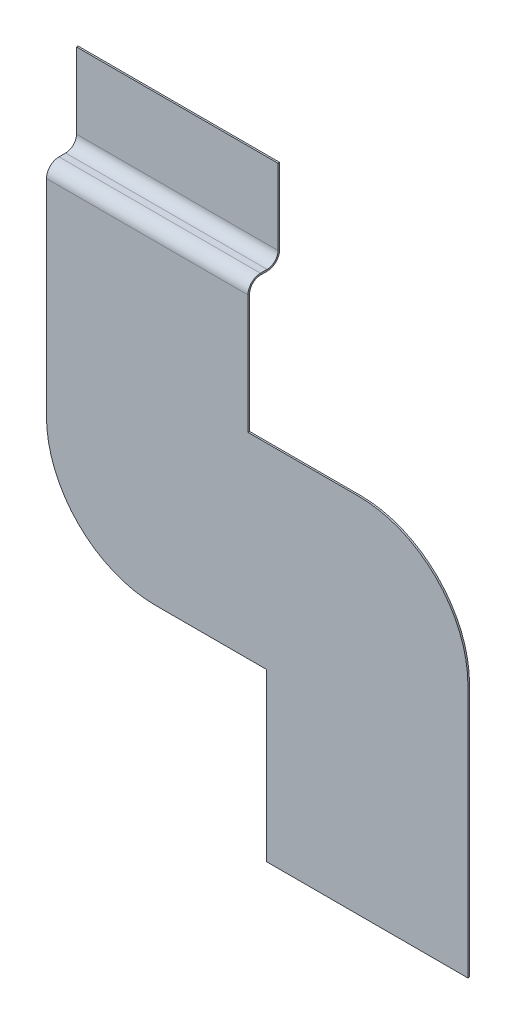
ISO-10303-21;
HEADER;
FILE_DESCRIPTION(('STEP AP214'),'2;1');
FILE_NAME('part.step','',(''),(''),'','','');
FILE_SCHEMA(('AUTOMOTIVE_DESIGN { 1 0 10303 214 1 1 1 1 }'));
ENDSEC;
DATA;
#1=APPLICATION_CONTEXT('core data for automotive mechanical design processes');
#2=APPLICATION_PROTOCOL_DEFINITION('international standard','automotive_design',2000,#1);
#3=PRODUCT_CONTEXT('',#1,'mechanical');
#4=PRODUCT('Part','Part','',(#3));
#5=PRODUCT_RELATED_PRODUCT_CATEGORY('part','',(#4));
#6=PRODUCT_DEFINITION_FORMATION('','',#4);
#7=PRODUCT_DEFINITION_CONTEXT('part definition',#1,'design');
#8=PRODUCT_DEFINITION('design','',#6,#7);
#9=PRODUCT_DEFINITION_SHAPE('','',#8);
#10=(LENGTH_UNIT() NAMED_UNIT(*) SI_UNIT(.MILLI.,.METRE.));
#11=(NAMED_UNIT(*) PLANE_ANGLE_UNIT() SI_UNIT($,.RADIAN.));
#12=(NAMED_UNIT(*) SI_UNIT($,.STERADIAN.) SOLID_ANGLE_UNIT());
#13=UNCERTAINTY_MEASURE_WITH_UNIT(LENGTH_MEASURE(1.E-05),#10,'distance_accuracy_value','');
#14=(GEOMETRIC_REPRESENTATION_CONTEXT(3) GLOBAL_UNCERTAINTY_ASSIGNED_CONTEXT((#13)) GLOBAL_UNIT_ASSIGNED_CONTEXT((#10,
#11,#12)) REPRESENTATION_CONTEXT('',''));
#15=CARTESIAN_POINT('',(0.,0.,0.));
#16=DIRECTION('',(0.,0.,1.));
#17=DIRECTION('',(1.,0.,0.));
#18=AXIS2_PLACEMENT_3D('',#15,#16,#17);
#19=CARTESIAN_POINT('',(82.83487754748,-57.35458374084,-2.399952));
#20=DIRECTION('',(-1.,0.,0.));
#21=DIRECTION('',(0.,0.,-1.));
#22=AXIS2_PLACEMENT_3D('',#19,#20,#21);
#23=CYLINDRICAL_SURFACE('',#22,1.15);
#24=DIRECTION('',(-1.,0.,0.));
#25=VECTOR('',#24,1.);
#26=CARTESIAN_POINT('',(12.19999999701,-57.35458374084,-3.549952));
#27=LINE('',#26,#25);
#28=CARTESIAN_POINT('',(12.19999999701,-57.35458374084,-3.549952));
#29=VERTEX_POINT('',#28);
#30=CARTESIAN_POINT('',(-6.300000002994,-57.35458374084,-3.549952));
#31=VERTEX_POINT('',#30);
#32=EDGE_CURVE('E313',#29,#31,#27,.T.);
#33=ORIENTED_EDGE('',*,*,#32,.F.);
#34=CARTESIAN_POINT('',(12.19999999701,-57.35458374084,-2.399952));
#35=DIRECTION('',(1.,0.,0.));
#36=DIRECTION('',(0.,-1.,0.));
#37=AXIS2_PLACEMENT_3D('',#34,#35,#36);
#38=CIRCLE('',#37,1.15);
#39=CARTESIAN_POINT('',(12.19999999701,-58.50458374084,-2.399952));
#40=VERTEX_POINT('',#39);
#41=EDGE_CURVE('E198',#40,#29,#38,.T.);
#42=ORIENTED_EDGE('',*,*,#41,.F.);
#43=DIRECTION('',(-1.,0.,0.));
#44=VECTOR('',#43,1.);
#45=CARTESIAN_POINT('',(12.19999999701,-58.50458374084,-2.399952));
#46=LINE('',#45,#44);
#47=CARTESIAN_POINT('',(-6.300000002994,-58.50458374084,-2.399952));
#48=VERTEX_POINT('',#47);
#49=EDGE_CURVE('E246',#40,#48,#46,.T.);
#50=ORIENTED_EDGE('',*,*,#49,.T.);
#51=CARTESIAN_POINT('',(-6.300000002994,-57.35458374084,-2.399952));
#52=DIRECTION('',(-1.,0.,0.));
#53=DIRECTION('',(0.,0.,-1.));
#54=AXIS2_PLACEMENT_3D('',#51,#52,#53);
#55=CIRCLE('',#54,1.15);
#56=EDGE_CURVE('E328',#31,#48,#55,.T.);
#57=ORIENTED_EDGE('',*,*,#56,.F.);
#58=EDGE_LOOP('',(#33,#42,#50,#57));
#59=FACE_BOUND('',#58,.T.);
#60=ADVANCED_FACE('F17',(#59),#23,.T.);
#61=CARTESIAN_POINT('',(3.699999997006,-78.43387219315,-1.79));
#62=DIRECTION('',(0.,0.,-1.));
#63=DIRECTION('',(0.,-1.,0.));
#64=AXIS2_PLACEMENT_3D('',#61,#62,#63);
#65=CYLINDRICAL_SURFACE('',#64,10.);
#66=DIRECTION('',(0.,0.,1.));
#67=VECTOR('',#66,1.);
#68=CARTESIAN_POINT('',(3.699999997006,-88.43387219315,-0.79));
#69=LINE('',#68,#67);
#70=CARTESIAN_POINT('',(3.699999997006,-88.43387219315,-0.79));
#71=VERTEX_POINT('',#70);
#72=CARTESIAN_POINT('',(3.699999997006,-88.43387219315,-0.64));
#73=VERTEX_POINT('',#72);
#74=EDGE_CURVE('E11',#71,#73,#69,.T.);
#75=ORIENTED_EDGE('',*,*,#74,.T.);
#76=CARTESIAN_POINT('',(3.699999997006,-78.43387219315,-0.64));
#77=DIRECTION('',(0.,0.,-1.));
#78=DIRECTION('',(0.,-1.,0.));
#79=AXIS2_PLACEMENT_3D('',#76,#77,#78);
#80=CIRCLE('',#79,10.);
#81=CARTESIAN_POINT('',(-6.300000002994,-78.43387219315,-0.64));
#82=VERTEX_POINT('',#81);
#83=EDGE_CURVE('E355',#73,#82,#80,.T.);
#84=ORIENTED_EDGE('',*,*,#83,.T.);
#85=DIRECTION('',(0.,0.,1.));
#86=VECTOR('',#85,1.);
#87=CARTESIAN_POINT('',(-6.300000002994,-78.43387219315,-0.79));
#88=LINE('',#87,#86);
#89=CARTESIAN_POINT('',(-6.300000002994,-78.43387219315,-0.79));
#90=VERTEX_POINT('',#89);
#91=EDGE_CURVE('E323',#90,#82,#88,.T.);
#92=ORIENTED_EDGE('',*,*,#91,.F.);
#93=CARTESIAN_POINT('',(3.699999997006,-78.43387219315,-0.79));
#94=DIRECTION('',(0.,0.,-1.));
#95=DIRECTION('',(0.,-1.,0.));
#96=AXIS2_PLACEMENT_3D('',#93,#94,#95);
#97=CIRCLE('',#96,10.);
#98=EDGE_CURVE('E260',#71,#90,#97,.T.);
#99=ORIENTED_EDGE('',*,*,#98,.F.);
#100=EDGE_LOOP('',(#75,#84,#92,#99));
#101=FACE_BOUND('',#100,.T.);
#102=ADVANCED_FACE('F403',(#101),#65,.T.);
#103=CARTESIAN_POINT('',(13.89373048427,-88.43387219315,-1.79));
#104=DIRECTION('',(0.,-1.,0.));
#105=DIRECTION('',(0.,0.,-1.));
#106=AXIS2_PLACEMENT_3D('',#103,#104,#105);
#107=PLANE('',#106);
#108=DIRECTION('',(0.,0.,1.));
#109=VECTOR('',#108,1.);
#110=CARTESIAN_POINT('',(13.89373048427,-88.43387219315,-0.79));
#111=LINE('',#110,#109);
#112=CARTESIAN_POINT('',(13.89373048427,-88.43387219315,-0.79));
#113=VERTEX_POINT('',#112);
#114=CARTESIAN_POINT('',(13.89373048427,-88.43387219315,-0.64));
#115=VERTEX_POINT('',#114);
#116=EDGE_CURVE('E20',#113,#115,#111,.T.);
#117=ORIENTED_EDGE('',*,*,#116,.T.);
#118=DIRECTION('',(-1.,0.,0.));
#119=VECTOR('',#118,1.);
#120=CARTESIAN_POINT('',(13.89373048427,-88.43387219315,-0.64));
#121=LINE('',#120,#119);
#122=EDGE_CURVE('E358',#115,#73,#121,.T.);
#123=ORIENTED_EDGE('',*,*,#122,.T.);
#124=ORIENTED_EDGE('',*,*,#74,.F.);
#125=DIRECTION('',(-1.,0.,0.));
#126=VECTOR('',#125,1.);
#127=CARTESIAN_POINT('',(13.89373048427,-88.43387219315,-0.79));
#128=LINE('',#127,#126);
#129=EDGE_CURVE('E251',#113,#71,#128,.T.);
#130=ORIENTED_EDGE('',*,*,#129,.F.);
#131=EDGE_LOOP('',(#117,#123,#124,#130));
#132=FACE_BOUND('',#131,.T.);
#133=ADVANCED_FACE('F394',(#132),#107,.T.);
#134=CARTESIAN_POINT('',(13.89373048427,-103.72,-1.79));
#135=DIRECTION('',(-1.,0.,0.));
#136=DIRECTION('',(0.,0.,1.));
#137=AXIS2_PLACEMENT_3D('',#134,#135,#136);
#138=PLANE('',#137);
#139=DIRECTION('',(0.,0.,1.));
#140=VECTOR('',#139,1.);
#141=CARTESIAN_POINT('',(13.89373048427,-103.72,-0.79));
#142=LINE('',#141,#140);
#143=CARTESIAN_POINT('',(13.89373048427,-103.72,-0.79));
#144=VERTEX_POINT('',#143);
#145=CARTESIAN_POINT('',(13.89373048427,-103.72,-0.64));
#146=VERTEX_POINT('',#145);
#147=EDGE_CURVE('E383',#144,#146,#142,.T.);
#148=ORIENTED_EDGE('',*,*,#147,.T.);
#149=DIRECTION('',(0.,1.,0.));
#150=VECTOR('',#149,1.);
#151=CARTESIAN_POINT('',(13.89373048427,-103.72,-0.64));
#152=LINE('',#151,#150);
#153=EDGE_CURVE('E362',#146,#115,#152,.T.);
#154=ORIENTED_EDGE('',*,*,#153,.T.);
#155=ORIENTED_EDGE('',*,*,#116,.F.);
#156=DIRECTION('',(0.,1.,0.));
#157=VECTOR('',#156,1.);
#158=CARTESIAN_POINT('',(13.89373048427,-103.72,-0.79));
#159=LINE('',#158,#157);
#160=EDGE_CURVE('E241',#144,#113,#159,.T.);
#161=ORIENTED_EDGE('',*,*,#160,.F.);
#162=EDGE_LOOP('',(#148,#154,#155,#161));
#163=FACE_BOUND('',#162,.T.);
#164=ADVANCED_FACE('F398',(#163),#138,.T.);
#165=CARTESIAN_POINT('',(32.39373048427,-103.72,-1.79));
#166=DIRECTION('',(0.,-1.,0.));
#167=DIRECTION('',(0.,0.,-1.));
#168=AXIS2_PLACEMENT_3D('',#165,#166,#167);
#169=PLANE('',#168);
#170=DIRECTION('',(0.,0.,1.));
#171=VECTOR('',#170,1.);
#172=CARTESIAN_POINT('',(32.39373048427,-103.72,-0.79));
#173=LINE('',#172,#171);
#174=CARTESIAN_POINT('',(32.39373048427,-103.72,-0.79));
#175=VERTEX_POINT('',#174);
#176=CARTESIAN_POINT('',(32.39373048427,-103.72,-0.64));
#177=VERTEX_POINT('',#176);
#178=EDGE_CURVE('E381',#175,#177,#173,.T.);
#179=ORIENTED_EDGE('',*,*,#178,.T.);
#180=DIRECTION('',(-1.,0.,0.));
#181=VECTOR('',#180,1.);
#182=CARTESIAN_POINT('',(32.39373048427,-103.72,-0.64));
#183=LINE('',#182,#181);
#184=EDGE_CURVE('E366',#177,#146,#183,.T.);
#185=ORIENTED_EDGE('',*,*,#184,.T.);
#186=ORIENTED_EDGE('',*,*,#147,.F.);
#187=DIRECTION('',(-1.,0.,0.));
#188=VECTOR('',#187,1.);
#189=CARTESIAN_POINT('',(32.39373048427,-103.72,-0.79));
#190=LINE('',#189,#188);
#191=EDGE_CURVE('E232',#175,#144,#190,.T.);
#192=ORIENTED_EDGE('',*,*,#191,.F.);
#193=EDGE_LOOP('',(#179,#185,#186,#192));
#194=FACE_BOUND('',#193,.T.);
#195=ADVANCED_FACE('F408',(#194),#169,.T.);
#196=CARTESIAN_POINT('',(32.39373048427,-80.43387219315,-1.79));
#197=DIRECTION('',(1.,0.,0.));
#198=DIRECTION('',(0.,1.,0.));
#199=AXIS2_PLACEMENT_3D('',#196,#197,#198);
#200=PLANE('',#199);
#201=DIRECTION('',(0.,0.,1.));
#202=VECTOR('',#201,1.);
#203=CARTESIAN_POINT('',(32.39373048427,-80.43387219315,-0.79));
#204=LINE('',#203,#202);
#205=CARTESIAN_POINT('',(32.39373048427,-80.43387219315,-0.79));
#206=VERTEX_POINT('',#205);
#207=CARTESIAN_POINT('',(32.39373048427,-80.43387219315,-0.64));
#208=VERTEX_POINT('',#207);
#209=EDGE_CURVE('E48',#206,#208,#204,.T.);
#210=ORIENTED_EDGE('',*,*,#209,.T.);
#211=DIRECTION('',(0.,-1.,0.));
#212=VECTOR('',#211,1.);
#213=CARTESIAN_POINT('',(32.39373048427,-80.43387219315,-0.64));
#214=LINE('',#213,#212);
#215=EDGE_CURVE('E371',#208,#177,#214,.T.);
#216=ORIENTED_EDGE('',*,*,#215,.T.);
#217=ORIENTED_EDGE('',*,*,#178,.F.);
#218=DIRECTION('',(0.,-1.,0.));
#219=VECTOR('',#218,1.);
#220=CARTESIAN_POINT('',(32.39373048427,-80.43387219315,-0.79));
#221=LINE('',#220,#219);
#222=EDGE_CURVE('E228',#206,#175,#221,.T.);
#223=ORIENTED_EDGE('',*,*,#222,.F.);
#224=EDGE_LOOP('',(#210,#216,#217,#223));
#225=FACE_BOUND('',#224,.T.);
#226=ADVANCED_FACE('F411',(#225),#200,.T.);
#227=CARTESIAN_POINT('',(22.39373048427,-80.43387219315,-1.79));
#228=DIRECTION('',(0.,0.,-1.));
#229=DIRECTION('',(0.,-1.,0.));
#230=AXIS2_PLACEMENT_3D('',#227,#228,#229);
#231=CYLINDRICAL_SURFACE('',#230,10.);
#232=DIRECTION('',(0.,0.,1.));
#233=VECTOR('',#232,1.);
#234=CARTESIAN_POINT('',(22.39373048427,-70.43387219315,-0.79));
#235=LINE('',#234,#233);
#236=CARTESIAN_POINT('',(22.39373048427,-70.43387219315,-0.79));
#237=VERTEX_POINT('',#236);
#238=CARTESIAN_POINT('',(22.39373048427,-70.43387219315,-0.64));
#239=VERTEX_POINT('',#238);
#240=EDGE_CURVE('E38',#237,#239,#235,.T.);
#241=ORIENTED_EDGE('',*,*,#240,.T.);
#242=CARTESIAN_POINT('',(22.39373048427,-80.43387219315,-0.64));
#243=DIRECTION('',(0.,0.,-1.));
#244=DIRECTION('',(0.,1.,0.));
#245=AXIS2_PLACEMENT_3D('',#242,#243,#244);
#246=CIRCLE('',#245,10.);
#247=EDGE_CURVE('E367',#239,#208,#246,.T.);
#248=ORIENTED_EDGE('',*,*,#247,.T.);
#249=ORIENTED_EDGE('',*,*,#209,.F.);
#250=CARTESIAN_POINT('',(22.39373048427,-80.43387219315,-0.79));
#251=DIRECTION('',(0.,0.,-1.));
#252=DIRECTION('',(0.,1.,0.));
#253=AXIS2_PLACEMENT_3D('',#250,#251,#252);
#254=CIRCLE('',#253,10.);
#255=EDGE_CURVE('E206',#237,#206,#254,.T.);
#256=ORIENTED_EDGE('',*,*,#255,.F.);
#257=EDGE_LOOP('',(#241,#248,#249,#256));
#258=FACE_BOUND('',#257,.T.);
#259=ADVANCED_FACE('F799',(#258),#231,.T.);
#260=CARTESIAN_POINT('',(12.19999999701,-70.43387219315,-1.79));
#261=DIRECTION('',(0.,1.,0.));
#262=DIRECTION('',(1.,0.,0.));
#263=AXIS2_PLACEMENT_3D('',#260,#261,#262);
#264=PLANE('',#263);
#265=DIRECTION('',(0.,0.,1.));
#266=VECTOR('',#265,1.);
#267=CARTESIAN_POINT('',(12.19999999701,-70.43387219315,-0.79));
#268=LINE('',#267,#266);
#269=CARTESIAN_POINT('',(12.19999999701,-70.43387219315,-0.79));
#270=VERTEX_POINT('',#269);
#271=CARTESIAN_POINT('',(12.19999999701,-70.43387219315,-0.64));
#272=VERTEX_POINT('',#271);
#273=EDGE_CURVE('E186',#270,#272,#268,.T.);
#274=ORIENTED_EDGE('',*,*,#273,.T.);
#275=DIRECTION('',(1.,0.,0.));
#276=VECTOR('',#275,1.);
#277=CARTESIAN_POINT('',(12.19999999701,-70.43387219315,-0.64));
#278=LINE('',#277,#276);
#279=EDGE_CURVE('E370',#272,#239,#278,.T.);
#280=ORIENTED_EDGE('',*,*,#279,.T.);
#281=ORIENTED_EDGE('',*,*,#240,.F.);
#282=DIRECTION('',(1.,0.,0.));
#283=VECTOR('',#282,1.);
#284=CARTESIAN_POINT('',(12.19999999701,-70.43387219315,-0.79));
#285=LINE('',#284,#283);
#286=EDGE_CURVE('E201',#270,#237,#285,.T.);
#287=ORIENTED_EDGE('',*,*,#286,.F.);
#288=EDGE_LOOP('',(#274,#280,#281,#287));
#289=FACE_BOUND('',#288,.T.);
#290=ADVANCED_FACE('F202',(#289),#264,.T.);
#291=CARTESIAN_POINT('',(0.,0.,-0.64));
#292=DIRECTION('',(0.,0.,-1.));
#293=DIRECTION('',(0.,-1.,0.));
#294=AXIS2_PLACEMENT_3D('',#291,#292,#293);
#295=PLANE('',#294);
#296=DIRECTION('',(-1.,0.,0.));
#297=VECTOR('',#296,1.);
#298=CARTESIAN_POINT('',(12.19999999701,-59.50458374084,-0.64));
#299=LINE('',#298,#297);
#300=CARTESIAN_POINT('',(12.19999999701,-59.50458374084,-0.64));
#301=VERTEX_POINT('',#300);
#302=CARTESIAN_POINT('',(-6.300000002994,-59.50458374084,-0.64));
#303=VERTEX_POINT('',#302);
#304=EDGE_CURVE('E343',#301,#303,#299,.T.);
#305=ORIENTED_EDGE('',*,*,#304,.T.);
#306=DIRECTION('',(0.,-1.,0.));
#307=VECTOR('',#306,1.);
#308=CARTESIAN_POINT('',(-6.300000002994,-59.50458374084,-0.64));
#309=LINE('',#308,#307);
#310=EDGE_CURVE('E327',#303,#82,#309,.T.);
#311=ORIENTED_EDGE('',*,*,#310,.T.);
#312=ORIENTED_EDGE('',*,*,#83,.F.);
#313=ORIENTED_EDGE('',*,*,#122,.F.);
#314=ORIENTED_EDGE('',*,*,#153,.F.);
#315=ORIENTED_EDGE('',*,*,#184,.F.);
#316=ORIENTED_EDGE('',*,*,#215,.F.);
#317=ORIENTED_EDGE('',*,*,#247,.F.);
#318=ORIENTED_EDGE('',*,*,#279,.F.);
#319=DIRECTION('',(0.,-1.,0.));
#320=VECTOR('',#319,1.);
#321=CARTESIAN_POINT('',(12.19999999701,-59.50458374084,-0.64));
#322=LINE('',#321,#320);
#323=EDGE_CURVE('E195',#301,#272,#322,.T.);
#324=ORIENTED_EDGE('',*,*,#323,.F.);
#325=EDGE_LOOP('',(#305,#311,#312,#313,#314,#315,#316,#317,#318,#324));
#326=FACE_BOUND('',#325,.T.);
#327=ADVANCED_FACE('F401',(#326),#295,.F.);
#328=CARTESIAN_POINT('',(-6.300000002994,-78.43387219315,-1.79));
#329=DIRECTION('',(-1.,0.,0.));
#330=DIRECTION('',(0.,0.,1.));
#331=AXIS2_PLACEMENT_3D('',#328,#329,#330);
#332=PLANE('',#331);
#333=ORIENTED_EDGE('',*,*,#56,.T.);
#334=DIRECTION('',(0.,0.,-1.));
#335=VECTOR('',#334,1.);
#336=CARTESIAN_POINT('',(-6.300000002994,-58.50458374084,-1.79));
#337=LINE('',#336,#335);
#338=CARTESIAN_POINT('',(-6.300000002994,-58.50458374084,-1.79));
#339=VERTEX_POINT('',#338);
#340=EDGE_CURVE('E242',#339,#48,#337,.T.);
#341=ORIENTED_EDGE('',*,*,#340,.F.);
#342=CARTESIAN_POINT('',(-6.300000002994,-59.50458374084,-1.79));
#343=DIRECTION('',(1.,0.,0.));
#344=DIRECTION('',(0.,1.,0.));
#345=AXIS2_PLACEMENT_3D('',#342,#343,#344);
#346=CIRCLE('',#345,1.);
#347=CARTESIAN_POINT('',(-6.300000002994,-59.50458374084,-0.79));
#348=VERTEX_POINT('',#347);
#349=EDGE_CURVE('E279',#339,#348,#346,.T.);
#350=ORIENTED_EDGE('',*,*,#349,.T.);
#351=DIRECTION('',(0.,1.,0.));
#352=VECTOR('',#351,1.);
#353=CARTESIAN_POINT('',(-6.300000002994,-78.43387219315,-0.79));
#354=LINE('',#353,#352);
#355=EDGE_CURVE('E270',#90,#348,#354,.T.);
#356=ORIENTED_EDGE('',*,*,#355,.F.);
#357=ORIENTED_EDGE('',*,*,#91,.T.);
#358=ORIENTED_EDGE('',*,*,#310,.F.);
#359=CARTESIAN_POINT('',(-6.300000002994,-59.50458374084,-1.79));
#360=DIRECTION('',(-1.,0.,0.));
#361=DIRECTION('',(0.,0.,1.));
#362=AXIS2_PLACEMENT_3D('',#359,#360,#361);
#363=CIRCLE('',#362,1.15);
#364=CARTESIAN_POINT('',(-6.300000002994,-58.35458374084,-1.79));
#365=VERTEX_POINT('',#364);
#366=EDGE_CURVE('E346',#303,#365,#363,.T.);
#367=ORIENTED_EDGE('',*,*,#366,.T.);
#368=DIRECTION('',(0.,0.,1.));
#369=VECTOR('',#368,1.);
#370=CARTESIAN_POINT('',(-6.300000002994,-58.35458374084,-2.399952));
#371=LINE('',#370,#369);
#372=CARTESIAN_POINT('',(-6.300000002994,-58.35458374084,-2.399952));
#373=VERTEX_POINT('',#372);
#374=EDGE_CURVE('E261',#373,#365,#371,.T.);
#375=ORIENTED_EDGE('',*,*,#374,.F.);
#376=CARTESIAN_POINT('',(-6.300000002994,-57.35458374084,-2.399952));
#377=DIRECTION('',(1.,0.,0.));
#378=DIRECTION('',(0.,-1.,0.));
#379=AXIS2_PLACEMENT_3D('',#376,#377,#378);
#380=CIRCLE('',#379,1.);
#381=CARTESIAN_POINT('',(-6.300000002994,-57.35458374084,-3.399952));
#382=VERTEX_POINT('',#381);
#383=EDGE_CURVE('E335',#373,#382,#380,.T.);
#384=ORIENTED_EDGE('',*,*,#383,.T.);
#385=DIRECTION('',(0.,-1.,0.));
#386=VECTOR('',#385,1.);
#387=CARTESIAN_POINT('',(-6.300000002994,-50.41999999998,-3.399952));
#388=LINE('',#387,#386);
#389=CARTESIAN_POINT('',(-6.300000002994,-50.41999999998,-3.399952));
#390=VERTEX_POINT('',#389);
#391=EDGE_CURVE('E225',#390,#382,#388,.T.);
#392=ORIENTED_EDGE('',*,*,#391,.F.);
#393=DIRECTION('',(0.,0.,1.));
#394=VECTOR('',#393,1.);
#395=CARTESIAN_POINT('',(-6.300000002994,-50.41999999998,-3.549952));
#396=LINE('',#395,#394);
#397=CARTESIAN_POINT('',(-6.300000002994,-50.41999999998,-3.549952));
#398=VERTEX_POINT('',#397);
#399=EDGE_CURVE('E226',#398,#390,#396,.T.);
#400=ORIENTED_EDGE('',*,*,#399,.F.);
#401=DIRECTION('',(0.,1.,0.));
#402=VECTOR('',#401,1.);
#403=CARTESIAN_POINT('',(-6.300000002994,-57.35458374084,-3.549952));
#404=LINE('',#403,#402);
#405=EDGE_CURVE('E237',#31,#398,#404,.T.);
#406=ORIENTED_EDGE('',*,*,#405,.F.);
#407=EDGE_LOOP('',(#333,#341,#350,#356,#357,#358,#367,#375,#384,#392,#400,#406));
#408=FACE_BOUND('',#407,.T.);
#409=ADVANCED_FACE('F702',(#408),#332,.T.);
#410=CARTESIAN_POINT('',(82.83487754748,-59.50458374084,-1.79));
#411=DIRECTION('',(-1.,0.,0.));
#412=DIRECTION('',(0.,0.,1.));
#413=AXIS2_PLACEMENT_3D('',#410,#411,#412);
#414=CYLINDRICAL_SURFACE('',#413,1.15);
#415=ORIENTED_EDGE('',*,*,#304,.F.);
#416=CARTESIAN_POINT('',(12.19999999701,-59.50458374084,-1.79));
#417=DIRECTION('',(1.,0.,0.));
#418=DIRECTION('',(0.,1.,0.));
#419=AXIS2_PLACEMENT_3D('',#416,#417,#418);
#420=CIRCLE('',#419,1.15);
#421=CARTESIAN_POINT('',(12.19999999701,-58.35458374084,-1.79));
#422=VERTEX_POINT('',#421);
#423=EDGE_CURVE('E282',#422,#301,#420,.T.);
#424=ORIENTED_EDGE('',*,*,#423,.F.);
#425=DIRECTION('',(-1.,0.,0.));
#426=VECTOR('',#425,1.);
#427=CARTESIAN_POINT('',(12.19999999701,-58.35458374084,-1.79));
#428=LINE('',#427,#426);
#429=EDGE_CURVE('E265',#422,#365,#428,.T.);
#430=ORIENTED_EDGE('',*,*,#429,.T.);
#431=ORIENTED_EDGE('',*,*,#366,.F.);
#432=EDGE_LOOP('',(#415,#424,#430,#431));
#433=FACE_BOUND('',#432,.T.);
#434=ADVANCED_FACE('F707',(#433),#414,.T.);
#435=CARTESIAN_POINT('',(12.19999999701,-58.35458374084,-3.399952));
#436=DIRECTION('',(0.,1.,0.));
#437=DIRECTION('',(1.,0.,0.));
#438=AXIS2_PLACEMENT_3D('',#435,#436,#437);
#439=PLANE('',#438);
#440=DIRECTION('',(1.,0.,0.));
#441=VECTOR('',#440,1.);
#442=CARTESIAN_POINT('',(-6.300000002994,-58.35458374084,-2.399952));
#443=LINE('',#442,#441);
#444=CARTESIAN_POINT('',(12.19999999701,-58.35458374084,-2.399952));
#445=VERTEX_POINT('',#444);
#446=EDGE_CURVE('E266',#373,#445,#443,.T.);
#447=ORIENTED_EDGE('',*,*,#446,.F.);
#448=ORIENTED_EDGE('',*,*,#374,.T.);
#449=ORIENTED_EDGE('',*,*,#429,.F.);
#450=DIRECTION('',(0.,0.,1.));
#451=VECTOR('',#450,1.);
#452=CARTESIAN_POINT('',(12.19999999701,-58.35458374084,-2.399952));
#453=LINE('',#452,#451);
#454=EDGE_CURVE('E285',#445,#422,#453,.T.);
#455=ORIENTED_EDGE('',*,*,#454,.F.);
#456=EDGE_LOOP('',(#447,#448,#449,#455));
#457=FACE_BOUND('',#456,.T.);
#458=ADVANCED_FACE('F728',(#457),#439,.T.);
#459=CARTESIAN_POINT('',(-56.7411470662,-57.35458374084,-2.399952));
#460=DIRECTION('',(1.,0.,0.));
#461=DIRECTION('',(0.,-1.,0.));
#462=AXIS2_PLACEMENT_3D('',#459,#460,#461);
#463=CYLINDRICAL_SURFACE('',#462,1.);
#464=CARTESIAN_POINT('',(12.19999999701,-57.35458374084,-2.399952));
#465=DIRECTION('',(-1.,0.,0.));
#466=DIRECTION('',(0.,0.,-1.));
#467=AXIS2_PLACEMENT_3D('',#464,#465,#466);
#468=CIRCLE('',#467,1.);
#469=CARTESIAN_POINT('',(12.19999999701,-57.35458374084,-3.399952));
#470=VERTEX_POINT('',#469);
#471=EDGE_CURVE('E297',#470,#445,#468,.T.);
#472=ORIENTED_EDGE('',*,*,#471,.F.);
#473=DIRECTION('',(1.,0.,0.));
#474=VECTOR('',#473,1.);
#475=CARTESIAN_POINT('',(-6.300000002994,-57.35458374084,-3.399952));
#476=LINE('',#475,#474);
#477=EDGE_CURVE('E332',#382,#470,#476,.T.);
#478=ORIENTED_EDGE('',*,*,#477,.F.);
#479=ORIENTED_EDGE('',*,*,#383,.F.);
#480=ORIENTED_EDGE('',*,*,#446,.T.);
#481=EDGE_LOOP('',(#472,#478,#479,#480));
#482=FACE_BOUND('',#481,.T.);
#483=ADVANCED_FACE('F722',(#482),#463,.F.);
#484=CARTESIAN_POINT('',(12.19999999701,-50.41999999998,-3.399952));
#485=DIRECTION('',(0.,0.,1.));
#486=DIRECTION('',(1.,0.,0.));
#487=AXIS2_PLACEMENT_3D('',#484,#485,#486);
#488=PLANE('',#487);
#489=DIRECTION('',(0.,-1.,0.));
#490=VECTOR('',#489,1.);
#491=CARTESIAN_POINT('',(12.19999999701,-50.41999999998,-3.399952));
#492=LINE('',#491,#490);
#493=CARTESIAN_POINT('',(12.19999999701,-50.41999999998,-3.399952));
#494=VERTEX_POINT('',#493);
#495=EDGE_CURVE('E293',#494,#470,#492,.T.);
#496=ORIENTED_EDGE('',*,*,#495,.F.);
#497=DIRECTION('',(-1.,0.,0.));
#498=VECTOR('',#497,1.);
#499=CARTESIAN_POINT('',(12.19999999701,-50.41999999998,-3.399952));
#500=LINE('',#499,#498);
#501=EDGE_CURVE('E223',#494,#390,#500,.T.);
#502=ORIENTED_EDGE('',*,*,#501,.T.);
#503=ORIENTED_EDGE('',*,*,#391,.T.);
#504=ORIENTED_EDGE('',*,*,#477,.T.);
#505=EDGE_LOOP('',(#496,#502,#503,#504));
#506=FACE_BOUND('',#505,.T.);
#507=ADVANCED_FACE('F727',(#506),#488,.T.);
#508=CARTESIAN_POINT('',(12.19999999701,-50.41999999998,-3.549952));
#509=DIRECTION('',(0.,1.,0.));
#510=DIRECTION('',(1.,0.,0.));
#511=AXIS2_PLACEMENT_3D('',#508,#509,#510);
#512=PLANE('',#511);
#513=DIRECTION('',(-1.,0.,0.));
#514=VECTOR('',#513,1.);
#515=CARTESIAN_POINT('',(12.19999999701,-50.41999999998,-3.549952));
#516=LINE('',#515,#514);
#517=CARTESIAN_POINT('',(12.19999999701,-50.41999999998,-3.549952));
#518=VERTEX_POINT('',#517);
#519=EDGE_CURVE('E233',#518,#398,#516,.T.);
#520=ORIENTED_EDGE('',*,*,#519,.T.);
#521=ORIENTED_EDGE('',*,*,#399,.T.);
#522=ORIENTED_EDGE('',*,*,#501,.F.);
#523=DIRECTION('',(0.,0.,1.));
#524=VECTOR('',#523,1.);
#525=CARTESIAN_POINT('',(12.19999999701,-50.41999999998,-3.549952));
#526=LINE('',#525,#524);
#527=EDGE_CURVE('E256',#518,#494,#526,.T.);
#528=ORIENTED_EDGE('',*,*,#527,.F.);
#529=EDGE_LOOP('',(#520,#521,#522,#528));
#530=FACE_BOUND('',#529,.T.);
#531=ADVANCED_FACE('F753',(#530),#512,.T.);
#532=CARTESIAN_POINT('',(12.19999999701,-58.50458374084,-3.549952));
#533=DIRECTION('',(0.,0.,-1.));
#534=DIRECTION('',(0.,-1.,0.));
#535=AXIS2_PLACEMENT_3D('',#532,#533,#534);
#536=PLANE('',#535);
#537=ORIENTED_EDGE('',*,*,#32,.T.);
#538=ORIENTED_EDGE('',*,*,#405,.T.);
#539=ORIENTED_EDGE('',*,*,#519,.F.);
#540=DIRECTION('',(0.,1.,0.));
#541=VECTOR('',#540,1.);
#542=CARTESIAN_POINT('',(12.19999999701,-57.35458374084,-3.549952));
#543=LINE('',#542,#541);
#544=EDGE_CURVE('E309',#29,#518,#543,.T.);
#545=ORIENTED_EDGE('',*,*,#544,.F.);
#546=EDGE_LOOP('',(#537,#538,#539,#545));
#547=FACE_BOUND('',#546,.T.);
#548=ADVANCED_FACE('F738',(#547),#536,.T.);
#549=CARTESIAN_POINT('',(12.19999999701,-59.87000003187,-1.79));
#550=DIRECTION('',(1.,0.,0.));
#551=DIRECTION('',(0.,1.,0.));
#552=AXIS2_PLACEMENT_3D('',#549,#550,#551);
#553=PLANE('',#552);
#554=ORIENTED_EDGE('',*,*,#527,.T.);
#555=ORIENTED_EDGE('',*,*,#495,.T.);
#556=ORIENTED_EDGE('',*,*,#471,.T.);
#557=ORIENTED_EDGE('',*,*,#454,.T.);
#558=ORIENTED_EDGE('',*,*,#423,.T.);
#559=ORIENTED_EDGE('',*,*,#323,.T.);
#560=ORIENTED_EDGE('',*,*,#273,.F.);
#561=DIRECTION('',(0.,1.,0.));
#562=VECTOR('',#561,1.);
#563=CARTESIAN_POINT('',(12.19999999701,-70.43387219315,-0.79));
#564=LINE('',#563,#562);
#565=CARTESIAN_POINT('',(12.19999999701,-59.50458374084,-0.79));
#566=VERTEX_POINT('',#565);
#567=EDGE_CURVE('E192',#270,#566,#564,.T.);
#568=ORIENTED_EDGE('',*,*,#567,.T.);
#569=CARTESIAN_POINT('',(12.19999999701,-59.50458374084,-1.79));
#570=DIRECTION('',(-1.,0.,0.));
#571=DIRECTION('',(0.,0.,1.));
#572=AXIS2_PLACEMENT_3D('',#569,#570,#571);
#573=CIRCLE('',#572,1.);
#574=CARTESIAN_POINT('',(12.19999999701,-58.50458374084,-1.79));
#575=VERTEX_POINT('',#574);
#576=EDGE_CURVE('E274',#566,#575,#573,.T.);
#577=ORIENTED_EDGE('',*,*,#576,.T.);
#578=DIRECTION('',(0.,0.,-1.));
#579=VECTOR('',#578,1.);
#580=CARTESIAN_POINT('',(12.19999999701,-58.50458374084,-1.79));
#581=LINE('',#580,#579);
#582=EDGE_CURVE('E252',#575,#40,#581,.T.);
#583=ORIENTED_EDGE('',*,*,#582,.T.);
#584=ORIENTED_EDGE('',*,*,#41,.T.);
#585=ORIENTED_EDGE('',*,*,#544,.T.);
#586=EDGE_LOOP('',(#554,#555,#556,#557,#558,#559,#560,#568,#577,#583,#584,#585));
#587=FACE_BOUND('',#586,.T.);
#588=ADVANCED_FACE('F189',(#587),#553,.T.);
#589=CARTESIAN_POINT('',(12.19999999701,-58.50458374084,-0.79));
#590=DIRECTION('',(0.,-1.,0.));
#591=DIRECTION('',(0.,0.,-1.));
#592=AXIS2_PLACEMENT_3D('',#589,#590,#591);
#593=PLANE('',#592);
#594=DIRECTION('',(1.,0.,0.));
#595=VECTOR('',#594,1.);
#596=CARTESIAN_POINT('',(-6.300000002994,-58.50458374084,-1.79));
#597=LINE('',#596,#595);
#598=EDGE_CURVE('E247',#339,#575,#597,.T.);
#599=ORIENTED_EDGE('',*,*,#598,.F.);
#600=ORIENTED_EDGE('',*,*,#340,.T.);
#601=ORIENTED_EDGE('',*,*,#49,.F.);
#602=ORIENTED_EDGE('',*,*,#582,.F.);
#603=EDGE_LOOP('',(#599,#600,#601,#602));
#604=FACE_BOUND('',#603,.T.);
#605=ADVANCED_FACE('F696',(#604),#593,.T.);
#606=CARTESIAN_POINT('',(-56.7411470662,-59.50458374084,-1.79));
#607=DIRECTION('',(1.,0.,0.));
#608=DIRECTION('',(0.,1.,0.));
#609=AXIS2_PLACEMENT_3D('',#606,#607,#608);
#610=CYLINDRICAL_SURFACE('',#609,1.);
#611=ORIENTED_EDGE('',*,*,#576,.F.);
#612=DIRECTION('',(1.,0.,0.));
#613=VECTOR('',#612,1.);
#614=CARTESIAN_POINT('',(-6.300000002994,-59.50458374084,-0.79));
#615=LINE('',#614,#613);
#616=EDGE_CURVE('E212',#348,#566,#615,.T.);
#617=ORIENTED_EDGE('',*,*,#616,.F.);
#618=ORIENTED_EDGE('',*,*,#349,.F.);
#619=ORIENTED_EDGE('',*,*,#598,.T.);
#620=EDGE_LOOP('',(#611,#617,#618,#619));
#621=FACE_BOUND('',#620,.T.);
#622=ADVANCED_FACE('F687',(#621),#610,.F.);
#623=CARTESIAN_POINT('',(0.,0.,-0.79));
#624=DIRECTION('',(0.,0.,-1.));
#625=DIRECTION('',(0.,-1.,0.));
#626=AXIS2_PLACEMENT_3D('',#623,#624,#625);
#627=PLANE('',#626);
#628=ORIENTED_EDGE('',*,*,#567,.F.);
#629=ORIENTED_EDGE('',*,*,#286,.T.);
#630=ORIENTED_EDGE('',*,*,#255,.T.);
#631=ORIENTED_EDGE('',*,*,#222,.T.);
#632=ORIENTED_EDGE('',*,*,#191,.T.);
#633=ORIENTED_EDGE('',*,*,#160,.T.);
#634=ORIENTED_EDGE('',*,*,#129,.T.);
#635=ORIENTED_EDGE('',*,*,#98,.T.);
#636=ORIENTED_EDGE('',*,*,#355,.T.);
#637=ORIENTED_EDGE('',*,*,#616,.T.);
#638=EDGE_LOOP('',(#628,#629,#630,#631,#632,#633,#634,#635,#636,#637));
#639=FACE_BOUND('',#638,.T.);
#640=ADVANCED_FACE('F209',(#639),#627,.T.);
#641=CLOSED_SHELL('',(#60,#102,#133,#164,#195,#226,#259,#290,#327,#409,#434,#458,#483,#507,#531,
#548,#588,#605,#622,#640));
#642=MANIFOLD_SOLID_BREP('B1',#641);
#643=ADVANCED_BREP_SHAPE_REPRESENTATION('',(#18,#642),#14);
#644=SHAPE_DEFINITION_REPRESENTATION(#9,#643);
ENDSEC;
END-ISO-10303-21;
